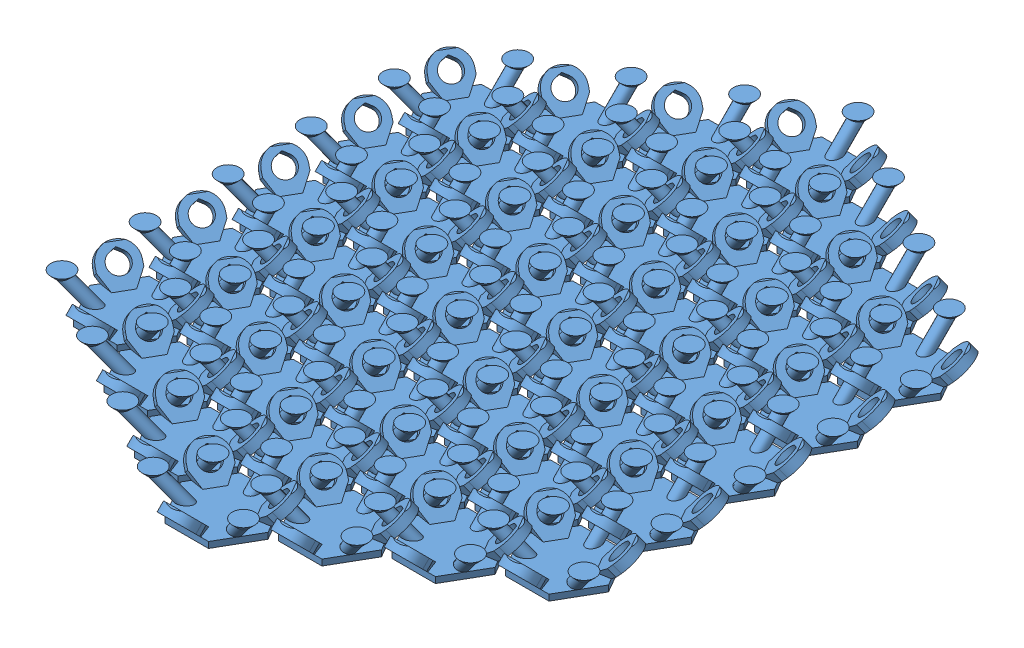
SolidWorks assembly chain4.SLDASM, configuration Default (file format 5000). Lengths in mm.
Overall size (72.11 4.2 93.12).
44 component instances, 1 part files, 0 mates.
Components (placement in the parent):
- piece4-1: piece4.SLDPRT [Default] at (-1.9687 -1.8543 2.2986) size (14.95 4.2 16.12)
- piece4-2: piece4.SLDPRT [Default] at (7.5576 -1.8543 7.7986) size (14.95 4.2 16.12)
- piece4-3: piece4.SLDPRT [Default] at (17.0839 -1.8543 13.2986) size (14.95 4.2 16.12)
- piece4-4: piece4.SLDPRT [Default] at (-11.495 -1.8543 7.7986) size (14.95 4.2 16.12)
- piece4-5: piece4.SLDPRT [Default] at (-1.9687 -1.8543 13.2986) size (14.95 4.2 16.12)
- piece4-6: piece4.SLDPRT [Default] at (7.5576 -1.8543 18.7986) size (14.95 4.2 16.12)
- piece4-7: piece4.SLDPRT [Default] at (-21.0213 -1.8543 13.2986) size (14.95 4.2 16.12)
- piece4-8: piece4.SLDPRT [Default] at (-11.495 -1.8543 18.7986) size (14.95 4.2 16.12)
- piece4-9: piece4.SLDPRT [Default] at (-1.9687 -1.8543 24.2986) size (14.95 4.2 16.12)
- piece4-10: piece4.SLDPRT [Default] at (26.6101 -1.8543 18.7986) size (14.95 4.2 16.12)
- piece4-12: piece4.SLDPRT [Default] at (17.0839 -1.8543 24.2986) size (14.95 4.2 16.12)
- piece4-13: piece4.SLDPRT [Default] at (26.6101 -1.8543 29.7986) size (14.95 4.2 16.12)
- piece4-14: piece4.SLDPRT [Default] at (7.5576 -1.8543 29.7986) size (14.95 4.2 16.12)
- piece4-15: piece4.SLDPRT [Default] at (17.0839 -1.8543 35.2986) size (14.95 4.2 16.12)
- piece4-16: piece4.SLDPRT [Default] at (-30.5475 -1.8543 18.7986) size (14.95 4.2 16.12)
- piece4-17: piece4.SLDPRT [Default] at (-21.0213 -1.8543 24.2986) size (14.95 4.2 16.12)
- piece4-18: piece4.SLDPRT [Default] at (-11.495 -1.8543 29.7986) size (14.95 4.2 16.12)
- piece4-19: piece4.SLDPRT [Default] at (-1.9687 -1.8543 35.2986) size (14.95 4.2 16.12)
- piece4-20: piece4.SLDPRT [Default] at (7.5576 -1.8543 40.7986) size (14.95 4.2 16.12)
- piece4-22: piece4.SLDPRT [Default] at (-30.5475 -1.8543 29.7986) size (14.95 4.2 16.12)
- piece4-23: piece4.SLDPRT [Default] at (-21.0213 -1.8543 35.2986) size (14.95 4.2 16.12)
- piece4-24: piece4.SLDPRT [Default] at (-11.495 -1.8543 40.7986) size (14.95 4.2 16.12)
- piece4-25: piece4.SLDPRT [Default] at (-1.9687 -1.8543 46.2986) size (14.95 4.2 16.12)
- piece4-26: piece4.SLDPRT [Default] at (26.6101 -1.8543 40.7986) size (14.95 4.2 16.12)
- piece4-27: piece4.SLDPRT [Default] at (17.0839 -1.8543 46.2986) size (14.95 4.2 16.12)
- piece4-28: piece4.SLDPRT [Default] at (26.6101 -1.8543 51.7986) size (14.95 4.2 16.12)
- piece4-29: piece4.SLDPRT [Default] at (7.5576 -1.8543 51.7986) size (14.95 4.2 16.12)
- piece4-30: piece4.SLDPRT [Default] at (17.0839 -1.8543 57.2986) size (14.95 4.2 16.12)
- piece4-31: piece4.SLDPRT [Default] at (26.6101 -1.8543 62.7986) size (14.95 4.2 16.12)
- piece4-32: piece4.SLDPRT [Default] at (-30.5475 -1.8543 40.7986) size (14.95 4.2 16.12)
- piece4-33: piece4.SLDPRT [Default] at (-21.0213 -1.8543 46.2986) size (14.95 4.2 16.12)
- piece4-34: piece4.SLDPRT [Default] at (-11.495 -1.8543 51.7986) size (14.95 4.2 16.12)
- piece4-35: piece4.SLDPRT [Default] at (-1.9687 -1.8543 57.2986) size (14.95 4.2 16.12)
- piece4-36: piece4.SLDPRT [Default] at (7.5576 -1.8543 62.7986) size (14.95 4.2 16.12)
- piece4-37: piece4.SLDPRT [Default] at (17.0839 -1.8543 68.2986) size (14.95 4.2 16.12)
- piece4-38: piece4.SLDPRT [Default] at (-30.5475 -1.8543 51.7986) size (14.95 4.2 16.12)
- piece4-39: piece4.SLDPRT [Default] at (-21.0213 -1.8543 57.2986) size (14.95 4.2 16.12)
- piece4-40: piece4.SLDPRT [Default] at (-11.495 -1.8543 62.7986) size (14.95 4.2 16.12)
- piece4-41: piece4.SLDPRT [Default] at (-1.9687 -1.8543 68.2986) size (14.95 4.2 16.12)
- piece4-42: piece4.SLDPRT [Default] at (7.5576 -1.8543 73.7986) size (14.95 4.2 16.12)
- piece4-43: piece4.SLDPRT [Default] at (-30.5475 -1.8543 62.7986) size (14.95 4.2 16.12)
- piece4-44: piece4.SLDPRT [Default] at (-21.0213 -1.8543 68.2986) size (14.95 4.2 16.12)
- piece4-45: piece4.SLDPRT [Default] at (-11.495 -1.8543 73.7986) size (14.95 4.2 16.12)
- piece4-46: piece4.SLDPRT [Default] at (-1.9687 -1.8543 79.2986) size (14.95 4.2 16.12)
